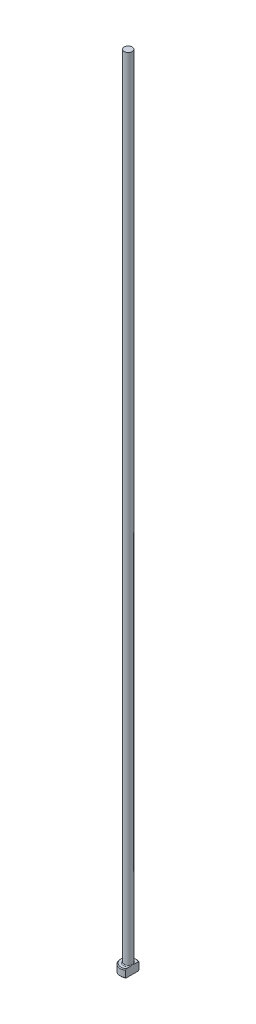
from build123d import *
from build123d.topology import SkipClean

# Parameters (mm, degrees)
CHAMFER1_SIZE = 0.2
FILLET1_R     = 0.2
KEY_DEPTH     = 201.019999


with BuildPart() as part:
    # Sketch1 → Revolve1 (revolve)
    with BuildSketch(Plane.XY, mode=Mode.PRIVATE) as revolve1_sk:
        Polygon((0, 0), (-2, 0), (-2, 2), (-1, 2), (-1, 200), (0, 200), align=None)
    revolve(revolve1_sk.sketch.rotate(Axis((0, 259.958771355, 0), (0, -1, 0)), 270), axis=Axis((0, 259.958771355, 0), (0, -1, 0)))

    # Chamfer1
    chamfer1_edges = [part.edges().sort_by_distance(p)[0] for p in [
        (0, 2, -2),
        (0, 0, -2),
    ]]
    chamfer(chamfer1_edges, length=CHAMFER1_SIZE)

    # Fillet1
    fillet1_edges = [part.edges().sort_by_distance(p)[0] for p in [
        (0, 2, -1),
    ]]
    fillet(fillet1_edges, radius=FILLET1_R)

    # Sketch2 → KEY (cut, through all)
    with SkipClean():  # the faces are left unmerged after this step: merging them gives an invalid solid
        with BuildSketch(Plane(origin=(0, 0, 0), x_dir=(1, 0, 0), z_dir=(0, 1, 0))):
            with BuildLine():
                Line((1, 1.732050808), (1, -1.732050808))
                ThreePointArc((1, -1.732050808), (2, 0), (1, 1.732050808))
            make_face()
        extrude(amount=KEY_DEPTH, mode=Mode.SUBTRACT)


solid = part.part
